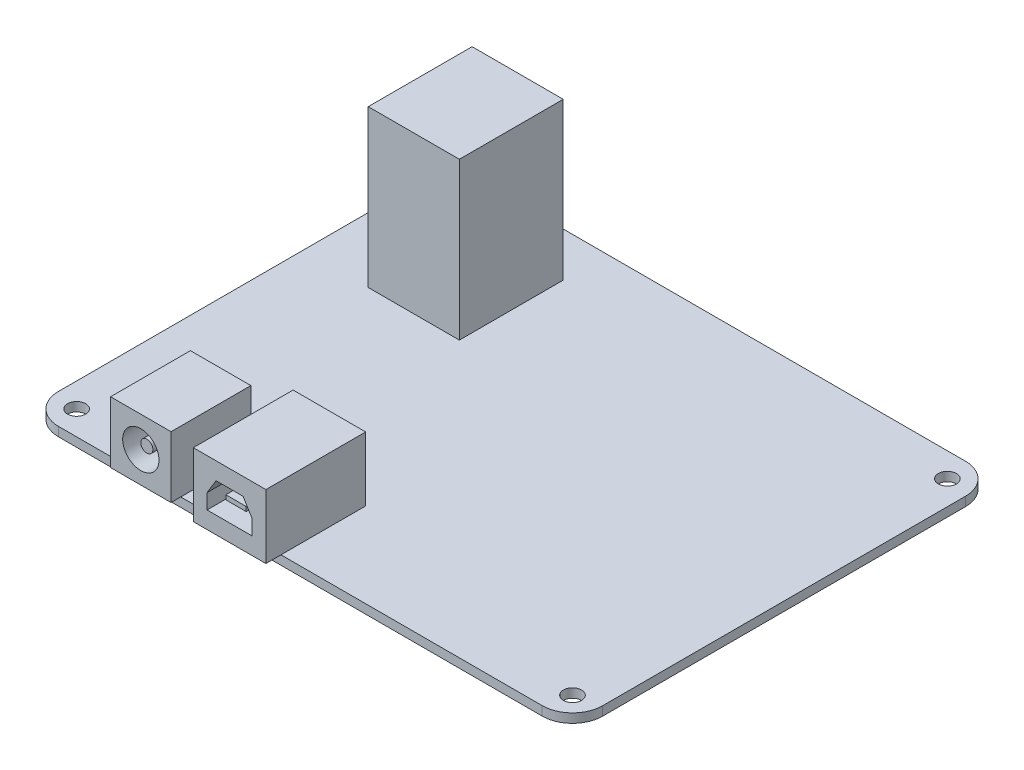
from build123d import *

# Parameters (mm, degrees)
SKETCH_1_W                                 = 90
SKETCH_1_H                                 = 70
EXTRUDE_1_DEPTH                            = 1.5
FILLET_1_R                                 = 5
SKETCH_2_R                                 = 1.5
CUT_EXTRUDE_1_DEPTH                        = 58.028501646
MIRROR_1_AT_THE_SECOND_PLANE_COPY_1_SKET_R = 1.5
MIRROR_1_AT_THE_SECOND_PLANE_COPY_1_DEPTH  = 58.028501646
SKETCH_3_W                                 = 10
SKETCH_3_H                                 = 13.2
EXTRUDE_2_DEPTH                            = 10.15
SKETCH_4_R                                 = 3
CUT_EXTRUDE_2_DEPTH                        = 5
SKETCH_5_R                                 = 1
EXTRUDE_3_DEPTH                            = 4
SKETCH_6_W                                 = 12
SKETCH_6_H                                 = 16.5
EXTRUDE_4_DEPTH                            = 10.6
CUT_EXTRUDE_3_DEPTH                        = 5
SKETCH_8_W                                 = 3.368656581
SKETCH_8_H                                 = 0.732316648
EXTRUDE_5_DEPTH                            = 4
SKETCH_9_W                                 = 15.070475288
SKETCH_9_H                                 = 17.177100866
EXTRUDE_6_DEPTH                            = 25.9


with BuildPart() as part:
    # Sketch 1 → Extrude 1 (new body)
    with BuildSketch(Plane(origin=(0, 0, 0), x_dir=(1, 0, 0), z_dir=(0, 1, 0))):
        Rectangle(SKETCH_1_W, SKETCH_1_H)
    extrude(amount=EXTRUDE_1_DEPTH)

    # Fillet 1
    fillet_1_edges = [part.edges().sort_by_distance(p)[0] for p in [
        (45, 0.75, 35),
        (-45, 0.75, 35),
        (-45, 0.75, -35),
        (45, 0.75, -35),
    ]]
    fillet(fillet_1_edges, radius=FILLET_1_R)

    # Sketch 2 → Cut-Extrude 1 (cut, through all)
    with BuildSketch(Plane(origin=(0, 1.5, 0), x_dir=(1, 0, 0), z_dir=(0, 1, 0))):
        with Locations(Location((-41, 31, 0), (0, 0, 270))):
            Circle(SKETCH_2_R)
    cut_extrude_1 = extrude(amount=-CUT_EXTRUDE_1_DEPTH, mode=Mode.SUBTRACT)

    # Mirror 1: Cut-Extrude 1 across plane
    add(cut_extrude_1.mirror(Plane(origin=(0, 0, 0), x_dir=(0, 0, 1), z_dir=(1, 0, 0))), mode=Mode.SUBTRACT)

    # Mirror 1 at the second plane: Cut-Extrude 1 across plane
    add(cut_extrude_1.mirror(Plane.XY), mode=Mode.SUBTRACT)

    # Mirror 1 at the second plane copy 1 sket → Mirror 1 at the second plane copy 1 (cut, through all)
    with BuildSketch(Plane(origin=(0, 1.5, 0), x_dir=(-1, 0, 0), z_dir=(0, 1, 0))):
        with Locations(Location((-41, 31, 0), (0, 0, 270))):
            Circle(MIRROR_1_AT_THE_SECOND_PLANE_COPY_1_SKET_R)
    extrude(amount=-MIRROR_1_AT_THE_SECOND_PLANE_COPY_1_DEPTH, mode=Mode.SUBTRACT)

    # Sketch 3 → Extrude 2 (add)
    with BuildSketch(Plane(origin=(0, 1.5, 0), x_dir=(1, 0, 0), z_dir=(0, 1, 0))):
        with Locations((-24.78, -30)):
            Rectangle(SKETCH_3_W, SKETCH_3_H)
    extrude(amount=EXTRUDE_2_DEPTH)

    # Sketch 4 → Cut-Extrude 2 (cut)
    with BuildSketch(Plane.XY.offset(36.6)):
        with Locations((-24.78, 6.575)):
            Circle(SKETCH_4_R)
    extrude(amount=-CUT_EXTRUDE_2_DEPTH, mode=Mode.SUBTRACT)

    # Sketch 5 → Extrude 3 (add)
    with BuildSketch(Plane.XY.offset(31.6)):
        with Locations((-24.78, 6.575)):
            Circle(SKETCH_5_R)
    extrude(amount=EXTRUDE_3_DEPTH)

    # Sketch 6 → Extrude 4 (add)
    with BuildSketch(Plane(origin=(0, 1.5, 0), x_dir=(1, 0, 0), z_dir=(0, 1, 0))):
        with Locations((-9.2, -29.25)):
            Rectangle(SKETCH_6_W, SKETCH_6_H)
    extrude(amount=EXTRUDE_4_DEPTH)

    # Sketch 7 → Cut-Extrude 3 (cut)
    with BuildSketch(Plane.XY.offset(37.5)):
        Polygon((-6.962227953, 9.24798996), (-11.437772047, 9.24798996), (-12.926004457, 6.8), (-12.926004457, 4.315562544), (-5.473995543, 4.315562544), (-5.473995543, 6.8), align=None)
    extrude(amount=-CUT_EXTRUDE_3_DEPTH, mode=Mode.SUBTRACT)

    # Sketch 8 → Extrude 5 (add)
    with BuildSketch(Plane.XY.offset(32.5)):
        with Locations((-9.13712509, 6.681816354)):
            Rectangle(SKETCH_8_W, SKETCH_8_H)
    extrude(amount=EXTRUDE_5_DEPTH)

    # Sketch 9 → Extrude 6 (add)
    with BuildSketch(Plane(origin=(0, 1.5, 0), x_dir=(1, 0, 0), z_dir=(0, 1, 0))):
        with Locations((-26.737940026, 19.087039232)):
            Rectangle(SKETCH_9_W, SKETCH_9_H)
    extrude(amount=EXTRUDE_6_DEPTH)


solid = part.part
